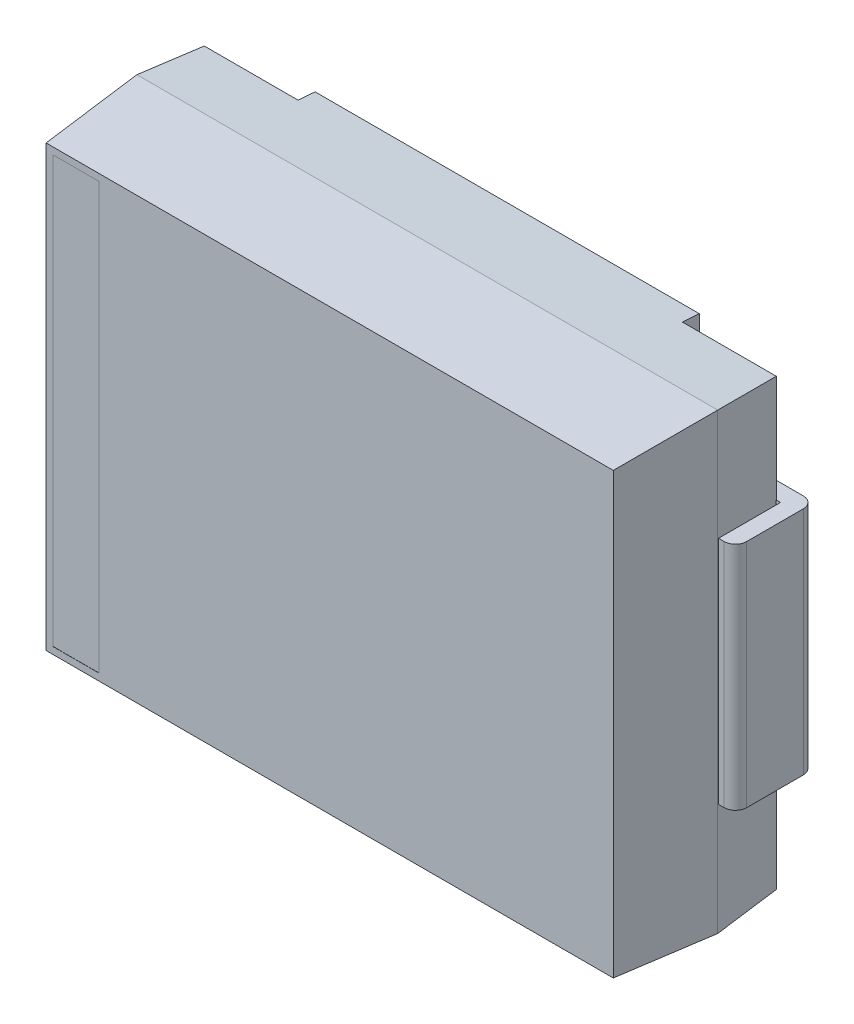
ISO-10303-21;
HEADER;
FILE_DESCRIPTION(('STEP AP214'),'2;1');
FILE_NAME('part.step','',(''),(''),'','','');
FILE_SCHEMA(('AUTOMOTIVE_DESIGN { 1 0 10303 214 1 1 1 1 }'));
ENDSEC;
DATA;
#1=APPLICATION_CONTEXT('core data for automotive mechanical design processes');
#2=APPLICATION_PROTOCOL_DEFINITION('international standard','automotive_design',2000,#1);
#3=PRODUCT_CONTEXT('',#1,'mechanical');
#4=PRODUCT('Part','Part','',(#3));
#5=PRODUCT_RELATED_PRODUCT_CATEGORY('part','',(#4));
#6=PRODUCT_DEFINITION_FORMATION('','',#4);
#7=PRODUCT_DEFINITION_CONTEXT('part definition',#1,'design');
#8=PRODUCT_DEFINITION('design','',#6,#7);
#9=PRODUCT_DEFINITION_SHAPE('','',#8);
#10=(LENGTH_UNIT() NAMED_UNIT(*) SI_UNIT(.MILLI.,.METRE.));
#11=(NAMED_UNIT(*) PLANE_ANGLE_UNIT() SI_UNIT($,.RADIAN.));
#12=(NAMED_UNIT(*) SI_UNIT($,.STERADIAN.) SOLID_ANGLE_UNIT());
#13=UNCERTAINTY_MEASURE_WITH_UNIT(LENGTH_MEASURE(1.E-05),#10,'distance_accuracy_value','');
#14=(GEOMETRIC_REPRESENTATION_CONTEXT(3) GLOBAL_UNCERTAINTY_ASSIGNED_CONTEXT((#13)) GLOBAL_UNIT_ASSIGNED_CONTEXT((#10,
#11,#12)) REPRESENTATION_CONTEXT('',''));
#15=CARTESIAN_POINT('',(0.,0.,0.));
#16=DIRECTION('',(0.,0.,1.));
#17=DIRECTION('',(1.,0.,0.));
#18=AXIS2_PLACEMENT_3D('',#15,#16,#17);
#19=CARTESIAN_POINT('',(3.853333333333,1.5,0.146666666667));
#20=DIRECTION('',(0.,-1.,0.));
#21=DIRECTION('',(1.,0.,0.));
#22=AXIS2_PLACEMENT_3D('',#19,#20,#21);
#23=CYLINDRICAL_SURFACE('',#22,0.146666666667);
#24=DIRECTION('',(0.,1.,0.));
#25=VECTOR('',#24,1.);
#26=CARTESIAN_POINT('',(3.853333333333,0.,0.));
#27=LINE('',#26,#25);
#28=CARTESIAN_POINT('',(3.853333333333,1.5,0.));
#29=VERTEX_POINT('',#28);
#30=CARTESIAN_POINT('',(3.853333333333,-1.5,0.));
#31=VERTEX_POINT('',#30);
#32=EDGE_CURVE('E265',#29,#31,#27,.F.);
#33=ORIENTED_EDGE('',*,*,#32,.F.);
#34=CARTESIAN_POINT('',(3.853333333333,1.5,0.146666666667));
#35=DIRECTION('',(0.,-1.,0.));
#36=DIRECTION('',(1.,0.,0.));
#37=AXIS2_PLACEMENT_3D('',#34,#35,#36);
#38=CIRCLE('',#37,0.146666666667);
#39=CARTESIAN_POINT('',(4.,1.5,0.146666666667));
#40=VERTEX_POINT('',#39);
#41=EDGE_CURVE('E255',#29,#40,#38,.T.);
#42=ORIENTED_EDGE('',*,*,#41,.T.);
#43=DIRECTION('',(0.,1.,0.));
#44=VECTOR('',#43,1.);
#45=CARTESIAN_POINT('',(4.,1.5,0.146666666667));
#46=LINE('',#45,#44);
#47=CARTESIAN_POINT('',(4.,-1.5,0.146666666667));
#48=VERTEX_POINT('',#47);
#49=EDGE_CURVE('E240',#48,#40,#46,.T.);
#50=ORIENTED_EDGE('',*,*,#49,.F.);
#51=CARTESIAN_POINT('',(3.853333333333,-1.5,0.146666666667));
#52=DIRECTION('',(0.,-1.,0.));
#53=DIRECTION('',(1.,0.,0.));
#54=AXIS2_PLACEMENT_3D('',#51,#52,#53);
#55=CIRCLE('',#54,0.146666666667);
#56=EDGE_CURVE('E21',#48,#31,#55,.F.);
#57=ORIENTED_EDGE('',*,*,#56,.T.);
#58=EDGE_LOOP('',(#33,#42,#50,#57));
#59=FACE_BOUND('',#58,.T.);
#60=ADVANCED_FACE('F17',(#59),#23,.T.);
#61=CARTESIAN_POINT('',(-3.853333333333,-1.5,0.146666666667));
#62=DIRECTION('',(0.,1.,0.));
#63=DIRECTION('',(-1.,0.,0.));
#64=AXIS2_PLACEMENT_3D('',#61,#62,#63);
#65=CYLINDRICAL_SURFACE('',#64,0.146666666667);
#66=DIRECTION('',(0.,1.,0.));
#67=VECTOR('',#66,1.);
#68=CARTESIAN_POINT('',(-3.853333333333,0.,0.));
#69=LINE('',#68,#67);
#70=CARTESIAN_POINT('',(-3.853333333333,-1.5,0.));
#71=VERTEX_POINT('',#70);
#72=CARTESIAN_POINT('',(-3.853333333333,1.5,0.));
#73=VERTEX_POINT('',#72);
#74=EDGE_CURVE('E291',#71,#73,#69,.T.);
#75=ORIENTED_EDGE('',*,*,#74,.F.);
#76=CARTESIAN_POINT('',(-3.853333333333,-1.5,0.146666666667));
#77=DIRECTION('',(0.,1.,0.));
#78=DIRECTION('',(-1.,0.,0.));
#79=AXIS2_PLACEMENT_3D('',#76,#77,#78);
#80=CIRCLE('',#79,0.146666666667);
#81=CARTESIAN_POINT('',(-4.,-1.5,0.146666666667));
#82=VERTEX_POINT('',#81);
#83=EDGE_CURVE('E308',#71,#82,#80,.T.);
#84=ORIENTED_EDGE('',*,*,#83,.T.);
#85=DIRECTION('',(0.,-1.,0.));
#86=VECTOR('',#85,1.);
#87=CARTESIAN_POINT('',(-4.,-1.5,0.146666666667));
#88=LINE('',#87,#86);
#89=CARTESIAN_POINT('',(-4.,1.5,0.146666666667));
#90=VERTEX_POINT('',#89);
#91=EDGE_CURVE('E263',#90,#82,#88,.T.);
#92=ORIENTED_EDGE('',*,*,#91,.F.);
#93=CARTESIAN_POINT('',(-3.853333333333,1.5,0.146666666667));
#94=DIRECTION('',(0.,1.,0.));
#95=DIRECTION('',(-1.,0.,0.));
#96=AXIS2_PLACEMENT_3D('',#93,#94,#95);
#97=CIRCLE('',#96,0.146666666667);
#98=EDGE_CURVE('E378',#90,#73,#97,.F.);
#99=ORIENTED_EDGE('',*,*,#98,.T.);
#100=EDGE_LOOP('',(#75,#84,#92,#99));
#101=FACE_BOUND('',#100,.T.);
#102=ADVANCED_FACE('F383',(#101),#65,.T.);
#103=CARTESIAN_POINT('',(-3.246666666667,0.,0.));
#104=DIRECTION('',(0.,0.,-1.));
#105=DIRECTION('',(-1.,0.,0.));
#106=AXIS2_PLACEMENT_3D('',#103,#104,#105);
#107=PLANE('',#106);
#108=DIRECTION('',(-1.,0.,0.));
#109=VECTOR('',#108,1.);
#110=CARTESIAN_POINT('',(-3.246666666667,1.5,0.));
#111=LINE('',#110,#109);
#112=CARTESIAN_POINT('',(-2.64,1.5,0.));
#113=VERTEX_POINT('',#112);
#114=EDGE_CURVE('E283',#73,#113,#111,.F.);
#115=ORIENTED_EDGE('',*,*,#114,.T.);
#116=DIRECTION('',(0.,1.,0.));
#117=VECTOR('',#116,1.);
#118=CARTESIAN_POINT('',(-2.64,1.5,0.));
#119=LINE('',#118,#117);
#120=CARTESIAN_POINT('',(-2.64,-1.5,0.));
#121=VERTEX_POINT('',#120);
#122=EDGE_CURVE('E298',#121,#113,#119,.T.);
#123=ORIENTED_EDGE('',*,*,#122,.F.);
#124=DIRECTION('',(-1.,0.,0.));
#125=VECTOR('',#124,1.);
#126=CARTESIAN_POINT('',(-3.246666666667,-1.5,0.));
#127=LINE('',#126,#125);
#128=EDGE_CURVE('E294',#121,#71,#127,.T.);
#129=ORIENTED_EDGE('',*,*,#128,.T.);
#130=ORIENTED_EDGE('',*,*,#74,.T.);
#131=EDGE_LOOP('',(#115,#123,#129,#130));
#132=FACE_BOUND('',#131,.T.);
#133=ADVANCED_FACE('F389',(#132),#107,.T.);
#134=CARTESIAN_POINT('',(3.246666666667,0.,0.));
#135=DIRECTION('',(0.,0.,-1.));
#136=DIRECTION('',(-1.,0.,0.));
#137=AXIS2_PLACEMENT_3D('',#134,#135,#136);
#138=PLANE('',#137);
#139=DIRECTION('',(-1.,0.,0.));
#140=VECTOR('',#139,1.);
#141=CARTESIAN_POINT('',(3.246666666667,-1.5,0.));
#142=LINE('',#141,#140);
#143=CARTESIAN_POINT('',(2.64,-1.5,0.));
#144=VERTEX_POINT('',#143);
#145=EDGE_CURVE('E251',#31,#144,#142,.T.);
#146=ORIENTED_EDGE('',*,*,#145,.T.);
#147=DIRECTION('',(0.,-1.,0.));
#148=VECTOR('',#147,1.);
#149=CARTESIAN_POINT('',(2.64,-1.5,0.));
#150=LINE('',#149,#148);
#151=CARTESIAN_POINT('',(2.64,1.5,0.));
#152=VERTEX_POINT('',#151);
#153=EDGE_CURVE('E271',#152,#144,#150,.T.);
#154=ORIENTED_EDGE('',*,*,#153,.F.);
#155=DIRECTION('',(-1.,0.,0.));
#156=VECTOR('',#155,1.);
#157=CARTESIAN_POINT('',(3.246666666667,1.5,0.));
#158=LINE('',#157,#156);
#159=EDGE_CURVE('E267',#152,#29,#158,.F.);
#160=ORIENTED_EDGE('',*,*,#159,.T.);
#161=ORIENTED_EDGE('',*,*,#32,.T.);
#162=EDGE_LOOP('',(#146,#154,#160,#161));
#163=FACE_BOUND('',#162,.T.);
#164=ADVANCED_FACE('F708',(#163),#138,.T.);
#165=CARTESIAN_POINT('',(4.,1.5,0.));
#166=DIRECTION('',(1.,0.,0.));
#167=DIRECTION('',(0.,1.,0.));
#168=AXIS2_PLACEMENT_3D('',#165,#166,#167);
#169=PLANE('',#168);
#170=DIRECTION('',(0.,0.,1.));
#171=VECTOR('',#170,1.);
#172=CARTESIAN_POINT('',(4.,-1.5,0.));
#173=LINE('',#172,#171);
#174=CARTESIAN_POINT('',(4.,-1.5,0.882438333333));
#175=VERTEX_POINT('',#174);
#176=EDGE_CURVE('E236',#175,#48,#173,.F.);
#177=ORIENTED_EDGE('',*,*,#176,.T.);
#178=ORIENTED_EDGE('',*,*,#49,.T.);
#179=DIRECTION('',(0.,0.,1.));
#180=VECTOR('',#179,1.);
#181=CARTESIAN_POINT('',(4.,1.5,0.));
#182=LINE('',#181,#180);
#183=CARTESIAN_POINT('',(4.,1.5,0.882438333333));
#184=VERTEX_POINT('',#183);
#185=EDGE_CURVE('E245',#40,#184,#182,.T.);
#186=ORIENTED_EDGE('',*,*,#185,.T.);
#187=DIRECTION('',(0.,-1.,0.));
#188=VECTOR('',#187,1.);
#189=CARTESIAN_POINT('',(4.,1.5,0.882438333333));
#190=LINE('',#189,#188);
#191=EDGE_CURVE('E243',#175,#184,#190,.F.);
#192=ORIENTED_EDGE('',*,*,#191,.F.);
#193=EDGE_LOOP('',(#177,#178,#186,#192));
#194=FACE_BOUND('',#193,.T.);
#195=ADVANCED_FACE('F238',(#194),#169,.T.);
#196=CARTESIAN_POINT('',(-4.,-1.5,0.));
#197=DIRECTION('',(-1.,0.,0.));
#198=DIRECTION('',(0.,-1.,0.));
#199=AXIS2_PLACEMENT_3D('',#196,#197,#198);
#200=PLANE('',#199);
#201=DIRECTION('',(0.,0.,1.));
#202=VECTOR('',#201,1.);
#203=CARTESIAN_POINT('',(-4.,1.5,0.));
#204=LINE('',#203,#202);
#205=CARTESIAN_POINT('',(-4.,1.5,0.882438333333));
#206=VERTEX_POINT('',#205);
#207=EDGE_CURVE('E259',#206,#90,#204,.F.);
#208=ORIENTED_EDGE('',*,*,#207,.T.);
#209=ORIENTED_EDGE('',*,*,#91,.T.);
#210=DIRECTION('',(0.,0.,1.));
#211=VECTOR('',#210,1.);
#212=CARTESIAN_POINT('',(-4.,-1.5,0.));
#213=LINE('',#212,#211);
#214=CARTESIAN_POINT('',(-4.,-1.5,0.882438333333));
#215=VERTEX_POINT('',#214);
#216=EDGE_CURVE('E257',#82,#215,#213,.T.);
#217=ORIENTED_EDGE('',*,*,#216,.T.);
#218=DIRECTION('',(0.,1.,0.));
#219=VECTOR('',#218,1.);
#220=CARTESIAN_POINT('',(-4.,-1.5,0.882438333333));
#221=LINE('',#220,#219);
#222=EDGE_CURVE('E371',#206,#215,#221,.F.);
#223=ORIENTED_EDGE('',*,*,#222,.F.);
#224=EDGE_LOOP('',(#208,#209,#217,#223));
#225=FACE_BOUND('',#224,.T.);
#226=ADVANCED_FACE('F702',(#225),#200,.T.);
#227=CARTESIAN_POINT('',(-2.64,1.5,0.));
#228=DIRECTION('',(1.,0.,0.));
#229=DIRECTION('',(0.,1.,0.));
#230=AXIS2_PLACEMENT_3D('',#227,#228,#229);
#231=PLANE('',#230);
#232=DIRECTION('',(0.,1.,0.));
#233=VECTOR('',#232,1.);
#234=CARTESIAN_POINT('',(-2.64,-2.892413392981,0.22));
#235=LINE('',#234,#233);
#236=CARTESIAN_POINT('',(-2.64,-1.5,0.22));
#237=VERTEX_POINT('',#236);
#238=CARTESIAN_POINT('',(-2.64,1.5,0.22));
#239=VERTEX_POINT('',#238);
#240=EDGE_CURVE('E342',#237,#239,#235,.T.);
#241=ORIENTED_EDGE('',*,*,#240,.F.);
#242=DIRECTION('',(0.,0.,1.));
#243=VECTOR('',#242,1.);
#244=CARTESIAN_POINT('',(-2.64,-1.5,0.));
#245=LINE('',#244,#243);
#246=EDGE_CURVE('E275',#237,#121,#245,.F.);
#247=ORIENTED_EDGE('',*,*,#246,.T.);
#248=ORIENTED_EDGE('',*,*,#122,.T.);
#249=DIRECTION('',(0.,0.,1.));
#250=VECTOR('',#249,1.);
#251=CARTESIAN_POINT('',(-2.64,1.5,0.));
#252=LINE('',#251,#250);
#253=EDGE_CURVE('E301',#113,#239,#252,.T.);
#254=ORIENTED_EDGE('',*,*,#253,.T.);
#255=EDGE_LOOP('',(#241,#247,#248,#254));
#256=FACE_BOUND('',#255,.T.);
#257=ADVANCED_FACE('F399',(#256),#231,.T.);
#258=CARTESIAN_POINT('',(2.64,-1.5,0.));
#259=DIRECTION('',(-1.,0.,0.));
#260=DIRECTION('',(0.,-1.,0.));
#261=AXIS2_PLACEMENT_3D('',#258,#259,#260);
#262=PLANE('',#261);
#263=DIRECTION('',(0.,1.,0.));
#264=VECTOR('',#263,1.);
#265=CARTESIAN_POINT('',(2.64,-2.892413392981,0.22));
#266=LINE('',#265,#264);
#267=CARTESIAN_POINT('',(2.64,1.5,0.22));
#268=VERTEX_POINT('',#267);
#269=CARTESIAN_POINT('',(2.64,-1.5,0.22));
#270=VERTEX_POINT('',#269);
#271=EDGE_CURVE('E318',#268,#270,#266,.F.);
#272=ORIENTED_EDGE('',*,*,#271,.F.);
#273=DIRECTION('',(0.,0.,1.));
#274=VECTOR('',#273,1.);
#275=CARTESIAN_POINT('',(2.64,1.5,0.));
#276=LINE('',#275,#274);
#277=EDGE_CURVE('E279',#268,#152,#276,.F.);
#278=ORIENTED_EDGE('',*,*,#277,.T.);
#279=ORIENTED_EDGE('',*,*,#153,.T.);
#280=DIRECTION('',(0.,0.,1.));
#281=VECTOR('',#280,1.);
#282=CARTESIAN_POINT('',(2.64,-1.5,0.));
#283=LINE('',#282,#281);
#284=EDGE_CURVE('E274',#144,#270,#283,.T.);
#285=ORIENTED_EDGE('',*,*,#284,.T.);
#286=EDGE_LOOP('',(#272,#278,#279,#285));
#287=FACE_BOUND('',#286,.T.);
#288=ADVANCED_FACE('F697',(#287),#262,.T.);
#289=CARTESIAN_POINT('',(3.853333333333,1.5,0.882438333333));
#290=DIRECTION('',(0.,-1.,0.));
#291=DIRECTION('',(1.,0.,0.));
#292=AXIS2_PLACEMENT_3D('',#289,#290,#291);
#293=CYLINDRICAL_SURFACE('',#292,0.146666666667);
#294=CARTESIAN_POINT('',(3.853333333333,-1.5,0.882438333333));
#295=DIRECTION('',(0.,-1.,0.));
#296=DIRECTION('',(1.,0.,0.));
#297=AXIS2_PLACEMENT_3D('',#294,#295,#296);
#298=CIRCLE('',#297,0.146666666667);
#299=CARTESIAN_POINT('',(3.853333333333,-1.5,1.029105));
#300=VERTEX_POINT('',#299);
#301=EDGE_CURVE('E374',#300,#175,#298,.F.);
#302=ORIENTED_EDGE('',*,*,#301,.T.);
#303=ORIENTED_EDGE('',*,*,#191,.T.);
#304=CARTESIAN_POINT('',(3.853333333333,1.5,0.882438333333));
#305=DIRECTION('',(0.,-1.,0.));
#306=DIRECTION('',(1.,0.,0.));
#307=AXIS2_PLACEMENT_3D('',#304,#305,#306);
#308=CIRCLE('',#307,0.146666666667);
#309=CARTESIAN_POINT('',(3.853333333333,1.5,1.029105));
#310=VERTEX_POINT('',#309);
#311=EDGE_CURVE('E288',#184,#310,#308,.T.);
#312=ORIENTED_EDGE('',*,*,#311,.T.);
#313=DIRECTION('',(0.,1.,0.));
#314=VECTOR('',#313,1.);
#315=CARTESIAN_POINT('',(3.853333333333,0.,1.029105));
#316=LINE('',#315,#314);
#317=EDGE_CURVE('E440',#310,#300,#316,.F.);
#318=ORIENTED_EDGE('',*,*,#317,.T.);
#319=EDGE_LOOP('',(#302,#303,#312,#318));
#320=FACE_BOUND('',#319,.T.);
#321=ADVANCED_FACE('F470',(#320),#293,.T.);
#322=CARTESIAN_POINT('',(-3.853333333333,-1.5,0.882438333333));
#323=DIRECTION('',(0.,1.,0.));
#324=DIRECTION('',(-1.,0.,0.));
#325=AXIS2_PLACEMENT_3D('',#322,#323,#324);
#326=CYLINDRICAL_SURFACE('',#325,0.146666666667);
#327=CARTESIAN_POINT('',(-3.853333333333,1.5,0.882438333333));
#328=DIRECTION('',(0.,1.,0.));
#329=DIRECTION('',(-1.,0.,0.));
#330=AXIS2_PLACEMENT_3D('',#327,#328,#329);
#331=CIRCLE('',#330,0.146666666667);
#332=CARTESIAN_POINT('',(-3.853333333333,1.5,1.029105));
#333=VERTEX_POINT('',#332);
#334=EDGE_CURVE('E369',#333,#206,#331,.F.);
#335=ORIENTED_EDGE('',*,*,#334,.T.);
#336=ORIENTED_EDGE('',*,*,#222,.T.);
#337=CARTESIAN_POINT('',(-3.853333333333,-1.5,0.882438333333));
#338=DIRECTION('',(0.,1.,0.));
#339=DIRECTION('',(-1.,0.,0.));
#340=AXIS2_PLACEMENT_3D('',#337,#338,#339);
#341=CIRCLE('',#340,0.146666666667);
#342=CARTESIAN_POINT('',(-3.853333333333,-1.5,1.029105));
#343=VERTEX_POINT('',#342);
#344=EDGE_CURVE('E372',#215,#343,#341,.T.);
#345=ORIENTED_EDGE('',*,*,#344,.T.);
#346=DIRECTION('',(0.,1.,0.));
#347=VECTOR('',#346,1.);
#348=CARTESIAN_POINT('',(-3.853333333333,0.,1.029105));
#349=LINE('',#348,#347);
#350=EDGE_CURVE('E411',#343,#333,#349,.T.);
#351=ORIENTED_EDGE('',*,*,#350,.T.);
#352=EDGE_LOOP('',(#335,#336,#345,#351));
#353=FACE_BOUND('',#352,.T.);
#354=ADVANCED_FACE('F691',(#353),#326,.T.);
#355=CARTESIAN_POINT('',(3.722413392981,-2.892413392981,0.22));
#356=DIRECTION('',(0.,0.,-1.));
#357=DIRECTION('',(-1.,0.,0.));
#358=AXIS2_PLACEMENT_3D('',#355,#356,#357);
#359=PLANE('',#358);
#360=DIRECTION('',(-1.,0.,0.));
#361=VECTOR('',#360,1.);
#362=CARTESIAN_POINT('',(3.722413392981,1.5,0.22));
#363=LINE('',#362,#361);
#364=CARTESIAN_POINT('',(-3.722413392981,1.5000000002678,0.22));
#365=VERTEX_POINT('',#364);
#366=EDGE_CURVE('E340',#239,#365,#363,.T.);
#367=ORIENTED_EDGE('',*,*,#366,.T.);
#368=DIRECTION('',(0.,1.,0.));
#369=VECTOR('',#368,1.);
#370=CARTESIAN_POINT('',(-3.722413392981,-2.892413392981,0.22));
#371=LINE('',#370,#369);
#372=CARTESIAN_POINT('',(-3.722413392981,2.892413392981,0.22));
#373=VERTEX_POINT('',#372);
#374=EDGE_CURVE('E322',#365,#373,#371,.T.);
#375=ORIENTED_EDGE('',*,*,#374,.T.);
#376=DIRECTION('',(-1.,0.,0.));
#377=VECTOR('',#376,1.);
#378=CARTESIAN_POINT('',(3.722413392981,2.892413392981,0.22));
#379=LINE('',#378,#377);
#380=CARTESIAN_POINT('',(-2.5,2.892413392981,0.22));
#381=VERTEX_POINT('',#380);
#382=EDGE_CURVE('E409',#373,#381,#379,.F.);
#383=ORIENTED_EDGE('',*,*,#382,.T.);
#384=DIRECTION('',(0.,1.,0.));
#385=VECTOR('',#384,1.);
#386=CARTESIAN_POINT('',(-2.5,0.,0.22));
#387=LINE('',#386,#385);
#388=CARTESIAN_POINT('',(-2.5,-2.892413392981,0.22));
#389=VERTEX_POINT('',#388);
#390=EDGE_CURVE('E531',#389,#381,#387,.T.);
#391=ORIENTED_EDGE('',*,*,#390,.F.);
#392=DIRECTION('',(-1.,0.,0.));
#393=VECTOR('',#392,1.);
#394=CARTESIAN_POINT('',(3.722413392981,-2.892413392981,0.22));
#395=LINE('',#394,#393);
#396=CARTESIAN_POINT('',(-3.722413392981,-2.892413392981,0.22));
#397=VERTEX_POINT('',#396);
#398=EDGE_CURVE('E359',#389,#397,#395,.T.);
#399=ORIENTED_EDGE('',*,*,#398,.T.);
#400=DIRECTION('',(0.,1.,0.));
#401=VECTOR('',#400,1.);
#402=CARTESIAN_POINT('',(-3.722413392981,-2.892413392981,0.22));
#403=LINE('',#402,#401);
#404=CARTESIAN_POINT('',(-3.722413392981,-1.5000000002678,0.22));
#405=VERTEX_POINT('',#404);
#406=EDGE_CURVE('E356',#397,#405,#403,.T.);
#407=ORIENTED_EDGE('',*,*,#406,.T.);
#408=DIRECTION('',(-1.,0.,0.));
#409=VECTOR('',#408,1.);
#410=CARTESIAN_POINT('',(3.722413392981,-1.5,0.22));
#411=LINE('',#410,#409);
#412=EDGE_CURVE('E358',#405,#237,#411,.F.);
#413=ORIENTED_EDGE('',*,*,#412,.T.);
#414=ORIENTED_EDGE('',*,*,#240,.T.);
#415=EDGE_LOOP('',(#367,#375,#383,#391,#399,#407,#413,#414));
#416=FACE_BOUND('',#415,.T.);
#417=ADVANCED_FACE('F401',(#416),#359,.T.);
#418=CARTESIAN_POINT('',(3.722413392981,-2.892413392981,0.22));
#419=DIRECTION('',(0.,0.,-1.));
#420=DIRECTION('',(-1.,0.,0.));
#421=AXIS2_PLACEMENT_3D('',#418,#419,#420);
#422=PLANE('',#421);
#423=ORIENTED_EDGE('',*,*,#271,.T.);
#424=DIRECTION('',(-1.,0.,0.));
#425=VECTOR('',#424,1.);
#426=CARTESIAN_POINT('',(3.722413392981,-1.5,0.22));
#427=LINE('',#426,#425);
#428=CARTESIAN_POINT('',(3.722413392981,-1.5000000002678,0.22));
#429=VERTEX_POINT('',#428);
#430=EDGE_CURVE('E315',#270,#429,#427,.F.);
#431=ORIENTED_EDGE('',*,*,#430,.T.);
#432=DIRECTION('',(0.,1.,0.));
#433=VECTOR('',#432,1.);
#434=CARTESIAN_POINT('',(3.722413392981,-2.892413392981,0.22));
#435=LINE('',#434,#433);
#436=CARTESIAN_POINT('',(3.722413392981,-2.892413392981,0.22));
#437=VERTEX_POINT('',#436);
#438=EDGE_CURVE('E319',#429,#437,#435,.F.);
#439=ORIENTED_EDGE('',*,*,#438,.T.);
#440=DIRECTION('',(-1.,0.,0.));
#441=VECTOR('',#440,1.);
#442=CARTESIAN_POINT('',(3.722413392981,-2.892413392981,0.22));
#443=LINE('',#442,#441);
#444=CARTESIAN_POINT('',(2.5,-2.892413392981,0.22));
#445=VERTEX_POINT('',#444);
#446=EDGE_CURVE('E321',#437,#445,#443,.T.);
#447=ORIENTED_EDGE('',*,*,#446,.T.);
#448=DIRECTION('',(0.,-1.,0.));
#449=VECTOR('',#448,1.);
#450=CARTESIAN_POINT('',(2.5,0.,0.22));
#451=LINE('',#450,#449);
#452=CARTESIAN_POINT('',(2.5,2.892413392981,0.22));
#453=VERTEX_POINT('',#452);
#454=EDGE_CURVE('E512',#453,#445,#451,.T.);
#455=ORIENTED_EDGE('',*,*,#454,.F.);
#456=DIRECTION('',(-1.,0.,0.));
#457=VECTOR('',#456,1.);
#458=CARTESIAN_POINT('',(3.722413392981,2.892413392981,0.22));
#459=LINE('',#458,#457);
#460=CARTESIAN_POINT('',(3.722413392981,2.892413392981,0.22));
#461=VERTEX_POINT('',#460);
#462=EDGE_CURVE('E338',#453,#461,#459,.F.);
#463=ORIENTED_EDGE('',*,*,#462,.T.);
#464=DIRECTION('',(0.,1.,0.));
#465=VECTOR('',#464,1.);
#466=CARTESIAN_POINT('',(3.722413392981,-2.892413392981,0.22));
#467=LINE('',#466,#465);
#468=CARTESIAN_POINT('',(3.722413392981,1.5000000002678,0.22));
#469=VERTEX_POINT('',#468);
#470=EDGE_CURVE('E335',#461,#469,#467,.F.);
#471=ORIENTED_EDGE('',*,*,#470,.T.);
#472=DIRECTION('',(-1.,0.,0.));
#473=VECTOR('',#472,1.);
#474=CARTESIAN_POINT('',(3.722413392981,1.5,0.22));
#475=LINE('',#474,#473);
#476=EDGE_CURVE('E337',#469,#268,#475,.T.);
#477=ORIENTED_EDGE('',*,*,#476,.T.);
#478=EDGE_LOOP('',(#423,#431,#439,#447,#455,#463,#471,#477));
#479=FACE_BOUND('',#478,.T.);
#480=ADVANCED_FACE('F500',(#479),#422,.T.);
#481=CARTESIAN_POINT('',(3.89,0.,1.029105));
#482=DIRECTION('',(0.,0.,-1.));
#483=DIRECTION('',(-1.,0.,0.));
#484=AXIS2_PLACEMENT_3D('',#481,#482,#483);
#485=PLANE('',#484);
#486=DIRECTION('',(-1.,0.,0.));
#487=VECTOR('',#486,1.);
#488=CARTESIAN_POINT('',(3.89,-1.5,1.029105));
#489=LINE('',#488,#487);
#490=CARTESIAN_POINT('',(3.78,-1.5,1.029105));
#491=VERTEX_POINT('',#490);
#492=EDGE_CURVE('E433',#300,#491,#489,.T.);
#493=ORIENTED_EDGE('',*,*,#492,.F.);
#494=ORIENTED_EDGE('',*,*,#317,.F.);
#495=DIRECTION('',(-1.,0.,0.));
#496=VECTOR('',#495,1.);
#497=CARTESIAN_POINT('',(3.89,1.5,1.029105));
#498=LINE('',#497,#496);
#499=CARTESIAN_POINT('',(3.78,1.5,1.029105));
#500=VERTEX_POINT('',#499);
#501=EDGE_CURVE('E317',#500,#310,#498,.F.);
#502=ORIENTED_EDGE('',*,*,#501,.F.);
#503=DIRECTION('',(0.,-1.,0.));
#504=VECTOR('',#503,1.);
#505=CARTESIAN_POINT('',(3.78,-1.5,1.029105));
#506=LINE('',#505,#504);
#507=EDGE_CURVE('E446',#491,#500,#506,.F.);
#508=ORIENTED_EDGE('',*,*,#507,.F.);
#509=EDGE_LOOP('',(#493,#494,#502,#508));
#510=FACE_BOUND('',#509,.T.);
#511=ADVANCED_FACE('F477',(#510),#485,.F.);
#512=CARTESIAN_POINT('',(-3.89,0.,1.029105));
#513=DIRECTION('',(0.,0.,-1.));
#514=DIRECTION('',(-1.,0.,0.));
#515=AXIS2_PLACEMENT_3D('',#512,#513,#514);
#516=PLANE('',#515);
#517=DIRECTION('',(-1.,0.,0.));
#518=VECTOR('',#517,1.);
#519=CARTESIAN_POINT('',(-3.89,1.5,1.029105));
#520=LINE('',#519,#518);
#521=CARTESIAN_POINT('',(-3.78,1.5,1.029105));
#522=VERTEX_POINT('',#521);
#523=EDGE_CURVE('E414',#333,#522,#520,.F.);
#524=ORIENTED_EDGE('',*,*,#523,.F.);
#525=ORIENTED_EDGE('',*,*,#350,.F.);
#526=DIRECTION('',(-1.,0.,0.));
#527=VECTOR('',#526,1.);
#528=CARTESIAN_POINT('',(-3.89,-1.5,1.029105));
#529=LINE('',#528,#527);
#530=CARTESIAN_POINT('',(-3.78,-1.5,1.029105));
#531=VERTEX_POINT('',#530);
#532=EDGE_CURVE('E415',#531,#343,#529,.T.);
#533=ORIENTED_EDGE('',*,*,#532,.F.);
#534=DIRECTION('',(0.,1.,0.));
#535=VECTOR('',#534,1.);
#536=CARTESIAN_POINT('',(-3.78,1.5,1.029105));
#537=LINE('',#536,#535);
#538=EDGE_CURVE('E420',#522,#531,#537,.F.);
#539=ORIENTED_EDGE('',*,*,#538,.F.);
#540=EDGE_LOOP('',(#524,#525,#533,#539));
#541=FACE_BOUND('',#540,.T.);
#542=ADVANCED_FACE('F681',(#541),#516,.F.);
#543=CARTESIAN_POINT('',(-2.5,2.876953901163,0.));
#544=DIRECTION('',(-1.,0.,0.));
#545=DIRECTION('',(0.,-1.,0.));
#546=AXIS2_PLACEMENT_3D('',#543,#544,#545);
#547=PLANE('',#546);
#548=ORIENTED_EDGE('',*,*,#390,.T.);
#549=DIRECTION('',(0.,-0.0700975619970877,-0.997540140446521));
#550=VECTOR('',#549,1.);
#551=CARTESIAN_POINT('',(-2.5,2.884683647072,0.11));
#552=LINE('',#551,#550);
#553=CARTESIAN_POINT('',(-2.5,2.87695390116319,0.));
#554=VERTEX_POINT('',#553);
#555=EDGE_CURVE('E530',#381,#554,#552,.T.);
#556=ORIENTED_EDGE('',*,*,#555,.T.);
#557=DIRECTION('',(0.,1.,0.));
#558=VECTOR('',#557,1.);
#559=CARTESIAN_POINT('',(-2.5,-2.876953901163,0.));
#560=LINE('',#559,#558);
#561=CARTESIAN_POINT('',(-2.5,-2.87695390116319,0.));
#562=VERTEX_POINT('',#561);
#563=EDGE_CURVE('E437',#562,#554,#560,.T.);
#564=ORIENTED_EDGE('',*,*,#563,.F.);
#565=DIRECTION('',(0.,-0.0700975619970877,0.997540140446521));
#566=VECTOR('',#565,1.);
#567=CARTESIAN_POINT('',(-2.5,-2.884683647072,0.11));
#568=LINE('',#567,#566);
#569=EDGE_CURVE('E417',#562,#389,#568,.T.);
#570=ORIENTED_EDGE('',*,*,#569,.T.);
#571=EDGE_LOOP('',(#548,#556,#564,#570));
#572=FACE_BOUND('',#571,.T.);
#573=ADVANCED_FACE('F538',(#572),#547,.T.);
#574=CARTESIAN_POINT('',(2.5,-2.876953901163,0.));
#575=DIRECTION('',(1.,0.,0.));
#576=DIRECTION('',(0.,1.,0.));
#577=AXIS2_PLACEMENT_3D('',#574,#575,#576);
#578=PLANE('',#577);
#579=ORIENTED_EDGE('',*,*,#454,.T.);
#580=DIRECTION('',(0.,0.0700975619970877,-0.997540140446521));
#581=VECTOR('',#580,1.);
#582=CARTESIAN_POINT('',(2.5,-2.884683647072,0.11));
#583=LINE('',#582,#581);
#584=CARTESIAN_POINT('',(2.5,-2.87695390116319,0.));
#585=VERTEX_POINT('',#584);
#586=EDGE_CURVE('E449',#445,#585,#583,.T.);
#587=ORIENTED_EDGE('',*,*,#586,.T.);
#588=DIRECTION('',(0.,1.,0.));
#589=VECTOR('',#588,1.);
#590=CARTESIAN_POINT('',(2.5,-2.876953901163,0.));
#591=LINE('',#590,#589);
#592=CARTESIAN_POINT('',(2.5,2.87695390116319,0.));
#593=VERTEX_POINT('',#592);
#594=EDGE_CURVE('E454',#593,#585,#591,.F.);
#595=ORIENTED_EDGE('',*,*,#594,.F.);
#596=DIRECTION('',(0.,0.0700975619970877,0.997540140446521));
#597=VECTOR('',#596,1.);
#598=CARTESIAN_POINT('',(2.5,2.884683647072,0.11));
#599=LINE('',#598,#597);
#600=EDGE_CURVE('E519',#593,#453,#599,.T.);
#601=ORIENTED_EDGE('',*,*,#600,.T.);
#602=EDGE_LOOP('',(#579,#587,#595,#601));
#603=FACE_BOUND('',#602,.T.);
#604=ADVANCED_FACE('F516',(#603),#578,.T.);
#605=CARTESIAN_POINT('',(3.78,-1.5,0.));
#606=DIRECTION('',(-1.,0.,0.));
#607=DIRECTION('',(0.,-1.,0.));
#608=AXIS2_PLACEMENT_3D('',#605,#606,#607);
#609=PLANE('',#608);
#610=ORIENTED_EDGE('',*,*,#507,.T.);
#611=DIRECTION('',(0.,0.,1.));
#612=VECTOR('',#611,1.);
#613=CARTESIAN_POINT('',(3.78,1.5,0.));
#614=LINE('',#613,#612);
#615=CARTESIAN_POINT('',(3.78,1.5,0.2222));
#616=VERTEX_POINT('',#615);
#617=EDGE_CURVE('E424',#500,#616,#614,.F.);
#618=ORIENTED_EDGE('',*,*,#617,.T.);
#619=DIRECTION('',(0.,1.,0.));
#620=VECTOR('',#619,1.);
#621=CARTESIAN_POINT('',(3.78,0.,0.2222));
#622=LINE('',#621,#620);
#623=CARTESIAN_POINT('',(3.78,-1.5,0.2222));
#624=VERTEX_POINT('',#623);
#625=EDGE_CURVE('E327',#616,#624,#622,.F.);
#626=ORIENTED_EDGE('',*,*,#625,.T.);
#627=DIRECTION('',(0.,0.,1.));
#628=VECTOR('',#627,1.);
#629=CARTESIAN_POINT('',(3.78,-1.5,0.316605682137));
#630=LINE('',#629,#628);
#631=EDGE_CURVE('E452',#491,#624,#630,.F.);
#632=ORIENTED_EDGE('',*,*,#631,.F.);
#633=EDGE_LOOP('',(#610,#618,#626,#632));
#634=FACE_BOUND('',#633,.T.);
#635=ADVANCED_FACE('F480',(#634),#609,.T.);
#636=CARTESIAN_POINT('',(-3.78,1.5,0.));
#637=DIRECTION('',(1.,0.,0.));
#638=DIRECTION('',(0.,1.,0.));
#639=AXIS2_PLACEMENT_3D('',#636,#637,#638);
#640=PLANE('',#639);
#641=ORIENTED_EDGE('',*,*,#538,.T.);
#642=DIRECTION('',(0.,0.,1.));
#643=VECTOR('',#642,1.);
#644=CARTESIAN_POINT('',(-3.78,-1.5,0.));
#645=LINE('',#644,#643);
#646=CARTESIAN_POINT('',(-3.78,-1.5,0.2222));
#647=VERTEX_POINT('',#646);
#648=EDGE_CURVE('E423',#531,#647,#645,.F.);
#649=ORIENTED_EDGE('',*,*,#648,.T.);
#650=DIRECTION('',(0.,1.,0.));
#651=VECTOR('',#650,1.);
#652=CARTESIAN_POINT('',(-3.78,0.,0.2222));
#653=LINE('',#652,#651);
#654=CARTESIAN_POINT('',(-3.78,1.5,0.2222));
#655=VERTEX_POINT('',#654);
#656=EDGE_CURVE('E348',#647,#655,#653,.T.);
#657=ORIENTED_EDGE('',*,*,#656,.T.);
#658=DIRECTION('',(0.,0.,1.));
#659=VECTOR('',#658,1.);
#660=CARTESIAN_POINT('',(-3.78,1.5,0.316605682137));
#661=LINE('',#660,#659);
#662=EDGE_CURVE('E427',#522,#655,#661,.F.);
#663=ORIENTED_EDGE('',*,*,#662,.F.);
#664=EDGE_LOOP('',(#641,#649,#657,#663));
#665=FACE_BOUND('',#664,.T.);
#666=ADVANCED_FACE('F675',(#665),#640,.T.);
#667=CARTESIAN_POINT('',(2.5,-2.876953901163,0.));
#668=DIRECTION('',(0.,0.,-1.));
#669=DIRECTION('',(-1.,0.,0.));
#670=AXIS2_PLACEMENT_3D('',#667,#668,#669);
#671=PLANE('',#670);
#672=DIRECTION('',(1.,0.,0.));
#673=VECTOR('',#672,1.);
#674=CARTESIAN_POINT('',(2.5,2.87695390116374,0.));
#675=LINE('',#674,#673);
#676=EDGE_CURVE('E355',#593,#554,#675,.F.);
#677=ORIENTED_EDGE('',*,*,#676,.F.);
#678=ORIENTED_EDGE('',*,*,#594,.T.);
#679=DIRECTION('',(1.,0.,0.));
#680=VECTOR('',#679,1.);
#681=CARTESIAN_POINT('',(-2.5,-2.87695390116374,0.));
#682=LINE('',#681,#680);
#683=EDGE_CURVE('E334',#562,#585,#682,.T.);
#684=ORIENTED_EDGE('',*,*,#683,.F.);
#685=ORIENTED_EDGE('',*,*,#563,.T.);
#686=EDGE_LOOP('',(#677,#678,#684,#685));
#687=FACE_BOUND('',#686,.T.);
#688=ADVANCED_FACE('F553',(#687),#671,.T.);
#689=CARTESIAN_POINT('',(3.49795115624,-1.5,0.316605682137));
#690=DIRECTION('',(0.,-1.,0.));
#691=DIRECTION('',(1.,0.,0.));
#692=AXIS2_PLACEMENT_3D('',#689,#690,#691);
#693=PLANE('',#692);
#694=ORIENTED_EDGE('',*,*,#284,.F.);
#695=ORIENTED_EDGE('',*,*,#145,.F.);
#696=ORIENTED_EDGE('',*,*,#56,.F.);
#697=ORIENTED_EDGE('',*,*,#176,.F.);
#698=ORIENTED_EDGE('',*,*,#301,.F.);
#699=ORIENTED_EDGE('',*,*,#492,.T.);
#700=ORIENTED_EDGE('',*,*,#631,.T.);
#701=DIRECTION('',(-1.,0.,0.));
#702=VECTOR('',#701,1.);
#703=CARTESIAN_POINT('',(3.21,-1.5,0.2222));
#704=LINE('',#703,#702);
#705=CARTESIAN_POINT('',(3.72256798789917,-1.5000000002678,0.222199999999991));
#706=VERTEX_POINT('',#705);
#707=EDGE_CURVE('E323',#624,#706,#704,.T.);
#708=ORIENTED_EDGE('',*,*,#707,.T.);
#709=DIRECTION('',(0.0700975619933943,0.,0.99754014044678));
#710=VECTOR('',#709,1.);
#711=CARTESIAN_POINT('',(3.722413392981,-1.50000000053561,0.22));
#712=LINE('',#711,#710);
#713=EDGE_CURVE('E331',#429,#706,#712,.T.);
#714=ORIENTED_EDGE('',*,*,#713,.F.);
#715=ORIENTED_EDGE('',*,*,#430,.F.);
#716=EDGE_LOOP('',(#694,#695,#696,#697,#698,#699,#700,#708,#714,#715));
#717=FACE_BOUND('',#716,.T.);
#718=ADVANCED_FACE('F250',(#717),#693,.T.);
#719=CARTESIAN_POINT('',(3.21,0.,0.2222));
#720=DIRECTION('',(0.,0.,-1.));
#721=DIRECTION('',(-1.,0.,0.));
#722=AXIS2_PLACEMENT_3D('',#719,#720,#721);
#723=PLANE('',#722);
#724=ORIENTED_EDGE('',*,*,#625,.F.);
#725=DIRECTION('',(-1.,0.,0.));
#726=VECTOR('',#725,1.);
#727=CARTESIAN_POINT('',(3.49795115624,1.5,0.2222));
#728=LINE('',#727,#726);
#729=CARTESIAN_POINT('',(3.72256798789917,1.5000000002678,0.222199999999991));
#730=VERTEX_POINT('',#729);
#731=EDGE_CURVE('E326',#730,#616,#728,.F.);
#732=ORIENTED_EDGE('',*,*,#731,.F.);
#733=DIRECTION('',(0.,1.,0.));
#734=VECTOR('',#733,1.);
#735=CARTESIAN_POINT('',(3.72256798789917,0.,0.222199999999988));
#736=LINE('',#735,#734);
#737=EDGE_CURVE('E328',#706,#730,#736,.T.);
#738=ORIENTED_EDGE('',*,*,#737,.F.);
#739=ORIENTED_EDGE('',*,*,#707,.F.);
#740=EDGE_LOOP('',(#724,#732,#738,#739));
#741=FACE_BOUND('',#740,.T.);
#742=ADVANCED_FACE('F487',(#741),#723,.F.);
#743=CARTESIAN_POINT('',(3.49795115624,1.5,0.316605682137));
#744=DIRECTION('',(0.,1.,0.));
#745=DIRECTION('',(-1.,0.,0.));
#746=AXIS2_PLACEMENT_3D('',#743,#744,#745);
#747=PLANE('',#746);
#748=ORIENTED_EDGE('',*,*,#501,.T.);
#749=ORIENTED_EDGE('',*,*,#311,.F.);
#750=ORIENTED_EDGE('',*,*,#185,.F.);
#751=ORIENTED_EDGE('',*,*,#41,.F.);
#752=ORIENTED_EDGE('',*,*,#159,.F.);
#753=ORIENTED_EDGE('',*,*,#277,.F.);
#754=ORIENTED_EDGE('',*,*,#476,.F.);
#755=DIRECTION('',(0.0700975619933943,0.,0.99754014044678));
#756=VECTOR('',#755,1.);
#757=CARTESIAN_POINT('',(3.722413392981,1.50000000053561,0.22));
#758=LINE('',#757,#756);
#759=EDGE_CURVE('E330',#730,#469,#758,.F.);
#760=ORIENTED_EDGE('',*,*,#759,.F.);
#761=ORIENTED_EDGE('',*,*,#731,.T.);
#762=ORIENTED_EDGE('',*,*,#617,.F.);
#763=EDGE_LOOP('',(#748,#749,#750,#751,#752,#753,#754,#760,#761,#762));
#764=FACE_BOUND('',#763,.T.);
#765=ADVANCED_FACE('F472',(#764),#747,.T.);
#766=CARTESIAN_POINT('',(-3.49795115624,1.5,0.316605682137));
#767=DIRECTION('',(0.,1.,0.));
#768=DIRECTION('',(-1.,0.,0.));
#769=AXIS2_PLACEMENT_3D('',#766,#767,#768);
#770=PLANE('',#769);
#771=ORIENTED_EDGE('',*,*,#253,.F.);
#772=ORIENTED_EDGE('',*,*,#114,.F.);
#773=ORIENTED_EDGE('',*,*,#98,.F.);
#774=ORIENTED_EDGE('',*,*,#207,.F.);
#775=ORIENTED_EDGE('',*,*,#334,.F.);
#776=ORIENTED_EDGE('',*,*,#523,.T.);
#777=ORIENTED_EDGE('',*,*,#662,.T.);
#778=DIRECTION('',(-1.,0.,0.));
#779=VECTOR('',#778,1.);
#780=CARTESIAN_POINT('',(-3.21,1.5,0.2222));
#781=LINE('',#780,#779);
#782=CARTESIAN_POINT('',(-3.72256798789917,1.5000000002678,0.222199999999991));
#783=VERTEX_POINT('',#782);
#784=EDGE_CURVE('E344',#655,#783,#781,.F.);
#785=ORIENTED_EDGE('',*,*,#784,.T.);
#786=DIRECTION('',(-0.0700975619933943,0.,0.99754014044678));
#787=VECTOR('',#786,1.);
#788=CARTESIAN_POINT('',(-3.722413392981,1.50000000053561,0.22));
#789=LINE('',#788,#787);
#790=EDGE_CURVE('E352',#365,#783,#789,.T.);
#791=ORIENTED_EDGE('',*,*,#790,.F.);
#792=ORIENTED_EDGE('',*,*,#366,.F.);
#793=EDGE_LOOP('',(#771,#772,#773,#774,#775,#776,#777,#785,#791,#792));
#794=FACE_BOUND('',#793,.T.);
#795=ADVANCED_FACE('F393',(#794),#770,.T.);
#796=CARTESIAN_POINT('',(-3.21,0.,0.2222));
#797=DIRECTION('',(0.,0.,-1.));
#798=DIRECTION('',(-1.,0.,0.));
#799=AXIS2_PLACEMENT_3D('',#796,#797,#798);
#800=PLANE('',#799);
#801=ORIENTED_EDGE('',*,*,#656,.F.);
#802=DIRECTION('',(1.,0.,0.));
#803=VECTOR('',#802,1.);
#804=CARTESIAN_POINT('',(-3.49795115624,-1.5,0.2222));
#805=LINE('',#804,#803);
#806=CARTESIAN_POINT('',(-3.72256798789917,-1.5000000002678,0.222199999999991));
#807=VERTEX_POINT('',#806);
#808=EDGE_CURVE('E347',#807,#647,#805,.F.);
#809=ORIENTED_EDGE('',*,*,#808,.F.);
#810=DIRECTION('',(0.,-1.,0.));
#811=VECTOR('',#810,1.);
#812=CARTESIAN_POINT('',(-3.72256798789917,0.,0.222199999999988));
#813=LINE('',#812,#811);
#814=EDGE_CURVE('E349',#783,#807,#813,.T.);
#815=ORIENTED_EDGE('',*,*,#814,.F.);
#816=ORIENTED_EDGE('',*,*,#784,.F.);
#817=EDGE_LOOP('',(#801,#809,#815,#816));
#818=FACE_BOUND('',#817,.T.);
#819=ADVANCED_FACE('F660',(#818),#800,.F.);
#820=CARTESIAN_POINT('',(-3.49795115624,-1.5,0.316605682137));
#821=DIRECTION('',(0.,-1.,0.));
#822=DIRECTION('',(1.,0.,0.));
#823=AXIS2_PLACEMENT_3D('',#820,#821,#822);
#824=PLANE('',#823);
#825=ORIENTED_EDGE('',*,*,#532,.T.);
#826=ORIENTED_EDGE('',*,*,#344,.F.);
#827=ORIENTED_EDGE('',*,*,#216,.F.);
#828=ORIENTED_EDGE('',*,*,#83,.F.);
#829=ORIENTED_EDGE('',*,*,#128,.F.);
#830=ORIENTED_EDGE('',*,*,#246,.F.);
#831=ORIENTED_EDGE('',*,*,#412,.F.);
#832=DIRECTION('',(-0.0700975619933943,0.,0.99754014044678));
#833=VECTOR('',#832,1.);
#834=CARTESIAN_POINT('',(-3.722413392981,-1.50000000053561,0.22));
#835=LINE('',#834,#833);
#836=EDGE_CURVE('E351',#807,#405,#835,.F.);
#837=ORIENTED_EDGE('',*,*,#836,.F.);
#838=ORIENTED_EDGE('',*,*,#808,.T.);
#839=ORIENTED_EDGE('',*,*,#648,.F.);
#840=EDGE_LOOP('',(#825,#826,#827,#828,#829,#830,#831,#837,#838,#839));
#841=FACE_BOUND('',#840,.T.);
#842=ADVANCED_FACE('F657',(#841),#824,.T.);
#843=CARTESIAN_POINT('',(3.722413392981,-2.892413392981,0.22));
#844=DIRECTION('',(0.99754014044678,0.,-0.0700975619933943));
#845=DIRECTION('',(0.,1.,0.));
#846=AXIS2_PLACEMENT_3D('',#843,#844,#845);
#847=PLANE('',#846);
#848=DIRECTION('',(-0.0699259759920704,-0.0699259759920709,-0.995098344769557));
#849=VECTOR('',#848,1.);
#850=CARTESIAN_POINT('',(3.7512066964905,2.9212066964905,0.62975));
#851=LINE('',#850,#849);
#852=CARTESIAN_POINT('',(3.78,2.95,1.0395));
#853=VERTEX_POINT('',#852);
#854=EDGE_CURVE('E563',#853,#461,#851,.T.);
#855=ORIENTED_EDGE('',*,*,#854,.F.);
#856=DIRECTION('',(0.,1.,0.));
#857=VECTOR('',#856,1.);
#858=CARTESIAN_POINT('',(3.78,0.,1.0395));
#859=LINE('',#858,#857);
#860=CARTESIAN_POINT('',(3.78,-2.95,1.0395));
#861=VERTEX_POINT('',#860);
#862=EDGE_CURVE('E565',#861,#853,#859,.T.);
#863=ORIENTED_EDGE('',*,*,#862,.F.);
#864=DIRECTION('',(0.0699259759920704,-0.0699259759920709,0.995098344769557));
#865=VECTOR('',#864,1.);
#866=CARTESIAN_POINT('',(3.7512066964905,-2.9212066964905,0.62975));
#867=LINE('',#866,#865);
#868=EDGE_CURVE('E365',#437,#861,#867,.T.);
#869=ORIENTED_EDGE('',*,*,#868,.F.);
#870=ORIENTED_EDGE('',*,*,#438,.F.);
#871=ORIENTED_EDGE('',*,*,#713,.T.);
#872=ORIENTED_EDGE('',*,*,#737,.T.);
#873=ORIENTED_EDGE('',*,*,#759,.T.);
#874=ORIENTED_EDGE('',*,*,#470,.F.);
#875=EDGE_LOOP('',(#855,#863,#869,#870,#871,#872,#873,#874));
#876=FACE_BOUND('',#875,.T.);
#877=ADVANCED_FACE('F492',(#876),#847,.T.);
#878=CARTESIAN_POINT('',(-3.722413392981,-2.892413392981,0.22));
#879=DIRECTION('',(0.,-0.99754014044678,-0.0700975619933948));
#880=DIRECTION('',(1.,0.,0.));
#881=AXIS2_PLACEMENT_3D('',#878,#879,#880);
#882=PLANE('',#881);
#883=DIRECTION('',(1.,0.,0.));
#884=VECTOR('',#883,1.);
#885=CARTESIAN_POINT('',(0.,-2.95,1.0395));
#886=LINE('',#885,#884);
#887=CARTESIAN_POINT('',(-3.78,-2.95,1.0395));
#888=VERTEX_POINT('',#887);
#889=EDGE_CURVE('E567',#888,#861,#886,.T.);
#890=ORIENTED_EDGE('',*,*,#889,.F.);
#891=DIRECTION('',(-0.0699259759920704,-0.0699259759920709,0.995098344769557));
#892=VECTOR('',#891,1.);
#893=CARTESIAN_POINT('',(-3.7512066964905,-2.9212066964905,0.62975));
#894=LINE('',#893,#892);
#895=EDGE_CURVE('E363',#397,#888,#894,.T.);
#896=ORIENTED_EDGE('',*,*,#895,.F.);
#897=ORIENTED_EDGE('',*,*,#398,.F.);
#898=ORIENTED_EDGE('',*,*,#569,.F.);
#899=ORIENTED_EDGE('',*,*,#683,.T.);
#900=ORIENTED_EDGE('',*,*,#586,.F.);
#901=ORIENTED_EDGE('',*,*,#446,.F.);
#902=ORIENTED_EDGE('',*,*,#868,.T.);
#903=EDGE_LOOP('',(#890,#896,#897,#898,#899,#900,#901,#902));
#904=FACE_BOUND('',#903,.T.);
#905=ADVANCED_FACE('F523',(#904),#882,.T.);
#906=CARTESIAN_POINT('',(-3.722413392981,2.892413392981,0.22));
#907=DIRECTION('',(-0.99754014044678,0.,-0.0700975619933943));
#908=DIRECTION('',(0.,-1.,0.));
#909=AXIS2_PLACEMENT_3D('',#906,#907,#908);
#910=PLANE('',#909);
#911=ORIENTED_EDGE('',*,*,#895,.T.);
#912=DIRECTION('',(0.,-1.,0.));
#913=VECTOR('',#912,1.);
#914=CARTESIAN_POINT('',(-3.78,0.,1.0395));
#915=LINE('',#914,#913);
#916=CARTESIAN_POINT('',(-3.78,2.95,1.0395));
#917=VERTEX_POINT('',#916);
#918=EDGE_CURVE('E572',#917,#888,#915,.T.);
#919=ORIENTED_EDGE('',*,*,#918,.F.);
#920=DIRECTION('',(-0.0699259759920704,0.0699259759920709,0.995098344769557));
#921=VECTOR('',#920,1.);
#922=CARTESIAN_POINT('',(-3.7512066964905,2.9212066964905,0.62975));
#923=LINE('',#922,#921);
#924=EDGE_CURVE('E548',#373,#917,#923,.T.);
#925=ORIENTED_EDGE('',*,*,#924,.F.);
#926=ORIENTED_EDGE('',*,*,#374,.F.);
#927=ORIENTED_EDGE('',*,*,#790,.T.);
#928=ORIENTED_EDGE('',*,*,#814,.T.);
#929=ORIENTED_EDGE('',*,*,#836,.T.);
#930=ORIENTED_EDGE('',*,*,#406,.F.);
#931=EDGE_LOOP('',(#911,#919,#925,#926,#927,#928,#929,#930));
#932=FACE_BOUND('',#931,.T.);
#933=ADVANCED_FACE('F726',(#932),#910,.T.);
#934=CARTESIAN_POINT('',(3.722413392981,2.892413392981,0.22));
#935=DIRECTION('',(0.,0.99754014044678,-0.0700975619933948));
#936=DIRECTION('',(-1.,0.,0.));
#937=AXIS2_PLACEMENT_3D('',#934,#935,#936);
#938=PLANE('',#937);
#939=DIRECTION('',(-1.,0.,0.));
#940=VECTOR('',#939,1.);
#941=CARTESIAN_POINT('',(0.,2.95,1.0395));
#942=LINE('',#941,#940);
#943=EDGE_CURVE('E577',#853,#917,#942,.T.);
#944=ORIENTED_EDGE('',*,*,#943,.F.);
#945=ORIENTED_EDGE('',*,*,#854,.T.);
#946=ORIENTED_EDGE('',*,*,#462,.F.);
#947=ORIENTED_EDGE('',*,*,#600,.F.);
#948=ORIENTED_EDGE('',*,*,#676,.T.);
#949=ORIENTED_EDGE('',*,*,#555,.F.);
#950=ORIENTED_EDGE('',*,*,#382,.F.);
#951=ORIENTED_EDGE('',*,*,#924,.T.);
#952=EDGE_LOOP('',(#944,#945,#946,#947,#948,#949,#950,#951));
#953=FACE_BOUND('',#952,.T.);
#954=ADVANCED_FACE('F547',(#953),#938,.T.);
#955=CARTESIAN_POINT('',(-3.001442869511,-2.771442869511,2.3078));
#956=DIRECTION('',(0.,0.,-1.));
#957=DIRECTION('',(-1.,0.,0.));
#958=AXIS2_PLACEMENT_3D('',#955,#956,#957);
#959=PLANE('',#958);
#960=DIRECTION('',(-1.,0.,0.));
#961=VECTOR('',#960,1.);
#962=CARTESIAN_POINT('',(-3.001442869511,2.771442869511,2.3078));
#963=LINE('',#962,#961);
#964=CARTESIAN_POINT('',(-3.001442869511,2.771442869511,2.3078));
#965=VERTEX_POINT('',#964);
#966=CARTESIAN_POINT('',(-3.601442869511,2.771442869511,2.3078));
#967=VERTEX_POINT('',#966);
#968=EDGE_CURVE('E584',#965,#967,#963,.T.);
#969=ORIENTED_EDGE('',*,*,#968,.T.);
#970=DIRECTION('',(0.,-1.,0.));
#971=VECTOR('',#970,1.);
#972=CARTESIAN_POINT('',(-3.601442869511,2.771442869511,2.3078));
#973=LINE('',#972,#971);
#974=CARTESIAN_POINT('',(-3.601442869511,-2.771442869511,2.3078));
#975=VERTEX_POINT('',#974);
#976=EDGE_CURVE('E587',#967,#975,#973,.T.);
#977=ORIENTED_EDGE('',*,*,#976,.T.);
#978=DIRECTION('',(1.,0.,0.));
#979=VECTOR('',#978,1.);
#980=CARTESIAN_POINT('',(-3.601442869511,-2.771442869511,2.3078));
#981=LINE('',#980,#979);
#982=CARTESIAN_POINT('',(-3.001442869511,-2.771442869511,2.3078));
#983=VERTEX_POINT('',#982);
#984=EDGE_CURVE('E593',#975,#983,#981,.T.);
#985=ORIENTED_EDGE('',*,*,#984,.T.);
#986=DIRECTION('',(0.,1.,0.));
#987=VECTOR('',#986,1.);
#988=CARTESIAN_POINT('',(-3.001442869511,-2.771442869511,2.3078));
#989=LINE('',#988,#987);
#990=EDGE_CURVE('E599',#983,#965,#989,.T.);
#991=ORIENTED_EDGE('',*,*,#990,.T.);
#992=EDGE_LOOP('',(#969,#977,#985,#991));
#993=FACE_BOUND('',#992,.T.);
#994=ADVANCED_FACE('F652',(#993),#959,.F.);
#995=CARTESIAN_POINT('',(3.78,-2.95,1.0395));
#996=DIRECTION('',(0.997540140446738,0.,0.0700975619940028));
#997=DIRECTION('',(0.,1.,0.));
#998=AXIS2_PLACEMENT_3D('',#995,#996,#997);
#999=PLANE('',#998);
#1000=DIRECTION('',(0.,1.,0.));
#1001=VECTOR('',#1000,1.);
#1002=CARTESIAN_POINT('',(3.690721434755,-2.860721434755,2.31));
#1003=LINE('',#1002,#1001);
#1004=CARTESIAN_POINT('',(3.690721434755,2.860721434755,2.31));
#1005=VERTEX_POINT('',#1004);
#1006=CARTESIAN_POINT('',(3.690721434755,-2.860721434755,2.31));
#1007=VERTEX_POINT('',#1006);
#1008=EDGE_CURVE('E606',#1005,#1007,#1003,.F.);
#1009=ORIENTED_EDGE('',*,*,#1008,.T.);
#1010=DIRECTION('',(-0.0699259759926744,0.0699259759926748,0.995098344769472));
#1011=VECTOR('',#1010,1.);
#1012=CARTESIAN_POINT('',(3.7353607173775,-2.9053607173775,1.67475));
#1013=LINE('',#1012,#1011);
#1014=EDGE_CURVE('E570',#861,#1007,#1013,.T.);
#1015=ORIENTED_EDGE('',*,*,#1014,.F.);
#1016=ORIENTED_EDGE('',*,*,#862,.T.);
#1017=DIRECTION('',(0.0699259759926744,0.0699259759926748,-0.995098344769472));
#1018=VECTOR('',#1017,1.);
#1019=CARTESIAN_POINT('',(3.7353607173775,2.9053607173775,1.67475));
#1020=LINE('',#1019,#1018);
#1021=EDGE_CURVE('E581',#1005,#853,#1020,.T.);
#1022=ORIENTED_EDGE('',*,*,#1021,.F.);
#1023=EDGE_LOOP('',(#1009,#1015,#1016,#1022));
#1024=FACE_BOUND('',#1023,.T.);
#1025=ADVANCED_FACE('F655',(#1024),#999,.T.);
#1026=CARTESIAN_POINT('',(-3.78,-2.95,1.0395));
#1027=DIRECTION('',(0.,-0.997540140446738,0.0700975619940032));
#1028=DIRECTION('',(1.,0.,0.));
#1029=AXIS2_PLACEMENT_3D('',#1026,#1027,#1028);
#1030=PLANE('',#1029);
#1031=DIRECTION('',(-1.,0.,0.));
#1032=VECTOR('',#1031,1.);
#1033=CARTESIAN_POINT('',(3.690721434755,-2.860721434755,2.31));
#1034=LINE('',#1033,#1032);
#1035=CARTESIAN_POINT('',(-3.690721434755,-2.860721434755,2.31));
#1036=VERTEX_POINT('',#1035);
#1037=EDGE_CURVE('E609',#1007,#1036,#1034,.T.);
#1038=ORIENTED_EDGE('',*,*,#1037,.T.);
#1039=DIRECTION('',(0.0699259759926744,0.0699259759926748,0.995098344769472));
#1040=VECTOR('',#1039,1.);
#1041=CARTESIAN_POINT('',(-3.7353607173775,-2.9053607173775,1.67475));
#1042=LINE('',#1041,#1040);
#1043=EDGE_CURVE('E575',#888,#1036,#1042,.T.);
#1044=ORIENTED_EDGE('',*,*,#1043,.F.);
#1045=ORIENTED_EDGE('',*,*,#889,.T.);
#1046=ORIENTED_EDGE('',*,*,#1014,.T.);
#1047=EDGE_LOOP('',(#1038,#1044,#1045,#1046));
#1048=FACE_BOUND('',#1047,.T.);
#1049=ADVANCED_FACE('F734',(#1048),#1030,.T.);
#1050=CARTESIAN_POINT('',(-3.78,2.95,1.0395));
#1051=DIRECTION('',(-0.997540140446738,0.,0.0700975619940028));
#1052=DIRECTION('',(0.,-1.,0.));
#1053=AXIS2_PLACEMENT_3D('',#1050,#1051,#1052);
#1054=PLANE('',#1053);
#1055=DIRECTION('',(0.,1.,0.));
#1056=VECTOR('',#1055,1.);
#1057=CARTESIAN_POINT('',(-3.690721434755,-2.860721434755,2.31));
#1058=LINE('',#1057,#1056);
#1059=CARTESIAN_POINT('',(-3.690721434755,2.860721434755,2.31));
#1060=VERTEX_POINT('',#1059);
#1061=EDGE_CURVE('E612',#1036,#1060,#1058,.T.);
#1062=ORIENTED_EDGE('',*,*,#1061,.T.);
#1063=DIRECTION('',(0.0699259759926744,-0.0699259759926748,0.995098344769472));
#1064=VECTOR('',#1063,1.);
#1065=CARTESIAN_POINT('',(-3.7353607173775,2.9053607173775,1.67475));
#1066=LINE('',#1065,#1064);
#1067=EDGE_CURVE('E579',#917,#1060,#1066,.T.);
#1068=ORIENTED_EDGE('',*,*,#1067,.F.);
#1069=ORIENTED_EDGE('',*,*,#918,.T.);
#1070=ORIENTED_EDGE('',*,*,#1043,.T.);
#1071=EDGE_LOOP('',(#1062,#1068,#1069,#1070));
#1072=FACE_BOUND('',#1071,.T.);
#1073=ADVANCED_FACE('F737',(#1072),#1054,.T.);
#1074=CARTESIAN_POINT('',(3.78,2.95,1.0395));
#1075=DIRECTION('',(0.,0.997540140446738,0.0700975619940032));
#1076=DIRECTION('',(-1.,0.,0.));
#1077=AXIS2_PLACEMENT_3D('',#1074,#1075,#1076);
#1078=PLANE('',#1077);
#1079=DIRECTION('',(-1.,0.,0.));
#1080=VECTOR('',#1079,1.);
#1081=CARTESIAN_POINT('',(3.690721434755,2.860721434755,2.31));
#1082=LINE('',#1081,#1080);
#1083=EDGE_CURVE('E615',#1060,#1005,#1082,.F.);
#1084=ORIENTED_EDGE('',*,*,#1083,.T.);
#1085=ORIENTED_EDGE('',*,*,#1021,.T.);
#1086=ORIENTED_EDGE('',*,*,#943,.T.);
#1087=ORIENTED_EDGE('',*,*,#1067,.T.);
#1088=EDGE_LOOP('',(#1084,#1085,#1086,#1087));
#1089=FACE_BOUND('',#1088,.T.);
#1090=ADVANCED_FACE('F19',(#1089),#1078,.T.);
#1091=CARTESIAN_POINT('',(-3.001442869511,2.771442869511,2.31));
#1092=DIRECTION('',(0.,1.,0.));
#1093=DIRECTION('',(-1.,0.,0.));
#1094=AXIS2_PLACEMENT_3D('',#1091,#1092,#1093);
#1095=PLANE('',#1094);
#1096=DIRECTION('',(-1.,0.,0.));
#1097=VECTOR('',#1096,1.);
#1098=CARTESIAN_POINT('',(3.690721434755,2.771442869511,2.31));
#1099=LINE('',#1098,#1097);
#1100=CARTESIAN_POINT('',(-3.001442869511,2.771442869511,2.31));
#1101=VERTEX_POINT('',#1100);
#1102=CARTESIAN_POINT('',(-3.601442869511,2.771442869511,2.31));
#1103=VERTEX_POINT('',#1102);
#1104=EDGE_CURVE('E618',#1101,#1103,#1099,.T.);
#1105=ORIENTED_EDGE('',*,*,#1104,.T.);
#1106=DIRECTION('',(0.,0.,1.));
#1107=VECTOR('',#1106,1.);
#1108=CARTESIAN_POINT('',(-3.601442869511,2.771442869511,2.31));
#1109=LINE('',#1108,#1107);
#1110=EDGE_CURVE('E590',#1103,#967,#1109,.F.);
#1111=ORIENTED_EDGE('',*,*,#1110,.T.);
#1112=ORIENTED_EDGE('',*,*,#968,.F.);
#1113=DIRECTION('',(0.,0.,1.));
#1114=VECTOR('',#1113,1.);
#1115=CARTESIAN_POINT('',(-3.001442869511,2.771442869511,2.31));
#1116=LINE('',#1115,#1114);
#1117=EDGE_CURVE('E602',#965,#1101,#1116,.T.);
#1118=ORIENTED_EDGE('',*,*,#1117,.T.);
#1119=EDGE_LOOP('',(#1105,#1111,#1112,#1118));
#1120=FACE_BOUND('',#1119,.T.);
#1121=ADVANCED_FACE('F635',(#1120),#1095,.F.);
#1122=CARTESIAN_POINT('',(-3.601442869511,2.771442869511,2.31));
#1123=DIRECTION('',(-1.,0.,0.));
#1124=DIRECTION('',(0.,-1.,0.));
#1125=AXIS2_PLACEMENT_3D('',#1122,#1123,#1124);
#1126=PLANE('',#1125);
#1127=DIRECTION('',(0.,1.,0.));
#1128=VECTOR('',#1127,1.);
#1129=CARTESIAN_POINT('',(-3.601442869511,-2.860721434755,2.31));
#1130=LINE('',#1129,#1128);
#1131=CARTESIAN_POINT('',(-3.601442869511,-2.771442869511,2.31));
#1132=VERTEX_POINT('',#1131);
#1133=EDGE_CURVE('E621',#1103,#1132,#1130,.F.);
#1134=ORIENTED_EDGE('',*,*,#1133,.T.);
#1135=DIRECTION('',(0.,0.,1.));
#1136=VECTOR('',#1135,1.);
#1137=CARTESIAN_POINT('',(-3.601442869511,-2.771442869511,2.31));
#1138=LINE('',#1137,#1136);
#1139=EDGE_CURVE('E596',#1132,#975,#1138,.F.);
#1140=ORIENTED_EDGE('',*,*,#1139,.T.);
#1141=ORIENTED_EDGE('',*,*,#976,.F.);
#1142=ORIENTED_EDGE('',*,*,#1110,.F.);
#1143=EDGE_LOOP('',(#1134,#1140,#1141,#1142));
#1144=FACE_BOUND('',#1143,.T.);
#1145=ADVANCED_FACE('F633',(#1144),#1126,.F.);
#1146=CARTESIAN_POINT('',(-3.601442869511,-2.771442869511,2.31));
#1147=DIRECTION('',(0.,-1.,0.));
#1148=DIRECTION('',(1.,0.,0.));
#1149=AXIS2_PLACEMENT_3D('',#1146,#1147,#1148);
#1150=PLANE('',#1149);
#1151=DIRECTION('',(-1.,0.,0.));
#1152=VECTOR('',#1151,1.);
#1153=CARTESIAN_POINT('',(3.690721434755,-2.771442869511,2.31));
#1154=LINE('',#1153,#1152);
#1155=CARTESIAN_POINT('',(-3.001442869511,-2.771442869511,2.31));
#1156=VERTEX_POINT('',#1155);
#1157=EDGE_CURVE('E27',#1132,#1156,#1154,.F.);
#1158=ORIENTED_EDGE('',*,*,#1157,.T.);
#1159=DIRECTION('',(0.,0.,1.));
#1160=VECTOR('',#1159,1.);
#1161=CARTESIAN_POINT('',(-3.001442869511,-2.771442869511,2.31));
#1162=LINE('',#1161,#1160);
#1163=EDGE_CURVE('E35',#1156,#983,#1162,.F.);
#1164=ORIENTED_EDGE('',*,*,#1163,.T.);
#1165=ORIENTED_EDGE('',*,*,#984,.F.);
#1166=ORIENTED_EDGE('',*,*,#1139,.F.);
#1167=EDGE_LOOP('',(#1158,#1164,#1165,#1166));
#1168=FACE_BOUND('',#1167,.T.);
#1169=ADVANCED_FACE('F627',(#1168),#1150,.F.);
#1170=CARTESIAN_POINT('',(-3.001442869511,-2.771442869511,2.31));
#1171=DIRECTION('',(1.,0.,0.));
#1172=DIRECTION('',(0.,1.,0.));
#1173=AXIS2_PLACEMENT_3D('',#1170,#1171,#1172);
#1174=PLANE('',#1173);
#1175=DIRECTION('',(0.,1.,0.));
#1176=VECTOR('',#1175,1.);
#1177=CARTESIAN_POINT('',(-3.001442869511,-2.860721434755,2.31));
#1178=LINE('',#1177,#1176);
#1179=EDGE_CURVE('E11',#1156,#1101,#1178,.T.);
#1180=ORIENTED_EDGE('',*,*,#1179,.T.);
#1181=ORIENTED_EDGE('',*,*,#1117,.F.);
#1182=ORIENTED_EDGE('',*,*,#990,.F.);
#1183=ORIENTED_EDGE('',*,*,#1163,.F.);
#1184=EDGE_LOOP('',(#1180,#1181,#1182,#1183));
#1185=FACE_BOUND('',#1184,.T.);
#1186=ADVANCED_FACE('F637',(#1185),#1174,.F.);
#1187=CARTESIAN_POINT('',(3.690721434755,-2.860721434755,2.31));
#1188=DIRECTION('',(0.,0.,-1.));
#1189=DIRECTION('',(-1.,0.,0.));
#1190=AXIS2_PLACEMENT_3D('',#1187,#1188,#1189);
#1191=PLANE('',#1190);
#1192=ORIENTED_EDGE('',*,*,#1157,.F.);
#1193=ORIENTED_EDGE('',*,*,#1133,.F.);
#1194=ORIENTED_EDGE('',*,*,#1104,.F.);
#1195=ORIENTED_EDGE('',*,*,#1179,.F.);
#1196=EDGE_LOOP('',(#1192,#1193,#1194,#1195));
#1197=FACE_BOUND('',#1196,.T.);
#1198=ORIENTED_EDGE('',*,*,#1061,.F.);
#1199=ORIENTED_EDGE('',*,*,#1037,.F.);
#1200=ORIENTED_EDGE('',*,*,#1008,.F.);
#1201=ORIENTED_EDGE('',*,*,#1083,.F.);
#1202=EDGE_LOOP('',(#1198,#1199,#1200,#1201));
#1203=FACE_BOUND('',#1202,.T.);
#1204=ADVANCED_FACE('F630',(#1197,#1203),#1191,.F.);
#1205=CLOSED_SHELL('',(#60,#102,#133,#164,#195,#226,#257,#288,#321,#354,#417,#480,#511,#542,
#573,#604,#635,#666,#688,#718,#742,#765,#795,#819,#842,#877,#905,#933,#954,#994,#1025,#1049,
#1073,#1090,#1121,#1145,#1169,#1186,#1204));
#1206=MANIFOLD_SOLID_BREP('B1',#1205);
#1207=ADVANCED_BREP_SHAPE_REPRESENTATION('',(#18,#1206),#14);
#1208=SHAPE_DEFINITION_REPRESENTATION(#9,#1207);
ENDSEC;
END-ISO-10303-21;
